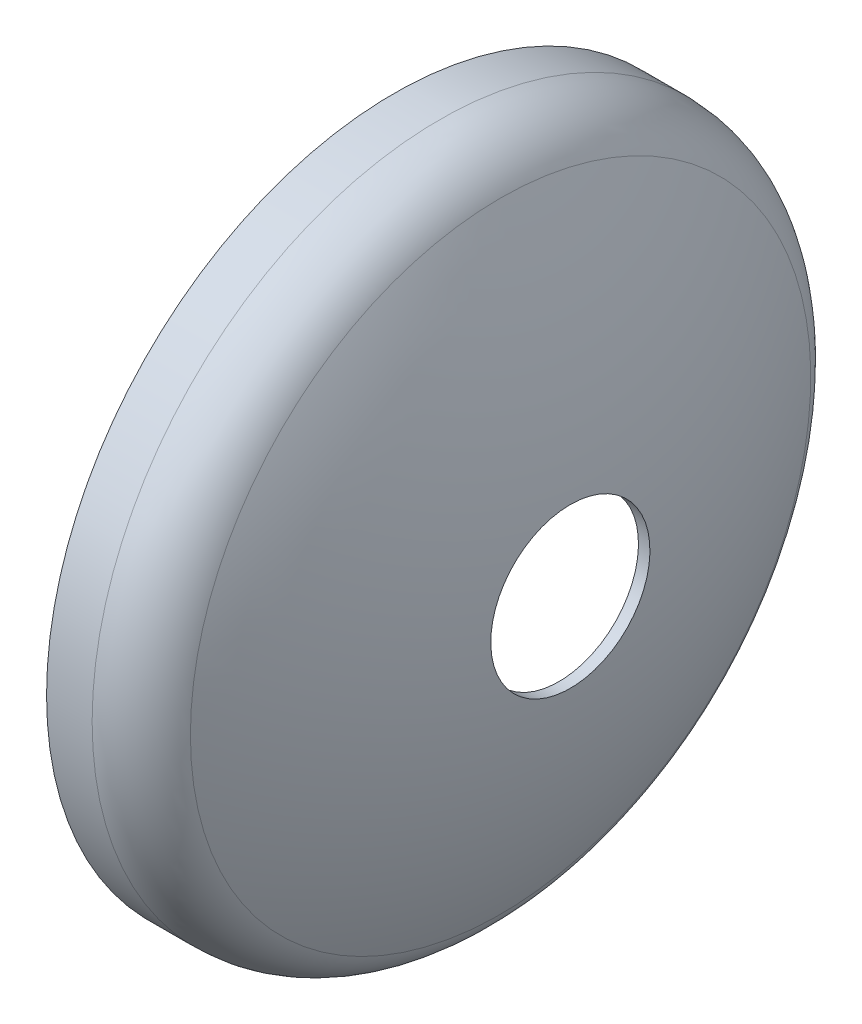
ISO-10303-21;
HEADER;
FILE_DESCRIPTION(('STEP AP214'),'2;1');
FILE_NAME('part.step','',(''),(''),'','','');
FILE_SCHEMA(('AUTOMOTIVE_DESIGN { 1 0 10303 214 1 1 1 1 }'));
ENDSEC;
DATA;
#1=APPLICATION_CONTEXT('core data for automotive mechanical design processes');
#2=APPLICATION_PROTOCOL_DEFINITION('international standard','automotive_design',2000,#1);
#3=PRODUCT_CONTEXT('',#1,'mechanical');
#4=PRODUCT('Part','Part','',(#3));
#5=PRODUCT_RELATED_PRODUCT_CATEGORY('part','',(#4));
#6=PRODUCT_DEFINITION_FORMATION('','',#4);
#7=PRODUCT_DEFINITION_CONTEXT('part definition',#1,'design');
#8=PRODUCT_DEFINITION('design','',#6,#7);
#9=PRODUCT_DEFINITION_SHAPE('','',#8);
#10=(LENGTH_UNIT() NAMED_UNIT(*) SI_UNIT(.MILLI.,.METRE.));
#11=(NAMED_UNIT(*) PLANE_ANGLE_UNIT() SI_UNIT($,.RADIAN.));
#12=(NAMED_UNIT(*) SI_UNIT($,.STERADIAN.) SOLID_ANGLE_UNIT());
#13=UNCERTAINTY_MEASURE_WITH_UNIT(LENGTH_MEASURE(1.E-05),#10,'distance_accuracy_value','');
#14=(GEOMETRIC_REPRESENTATION_CONTEXT(3) GLOBAL_UNCERTAINTY_ASSIGNED_CONTEXT((#13)) GLOBAL_UNIT_ASSIGNED_CONTEXT((#10,
#11,#12)) REPRESENTATION_CONTEXT('',''));
#15=CARTESIAN_POINT('',(0.,0.,0.));
#16=DIRECTION('',(0.,0.,1.));
#17=DIRECTION('',(1.,0.,0.));
#18=AXIS2_PLACEMENT_3D('',#15,#16,#17);
#19=CARTESIAN_POINT('',(108.777598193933,0.,0.));
#20=DIRECTION('',(-1.,0.,0.));
#21=DIRECTION('',(0.,1.,0.));
#22=AXIS2_PLACEMENT_3D('',#19,#20,#21);
#23=SPHERICAL_SURFACE('',#22,600.);
#24=CARTESIAN_POINT('',(643.46915575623,0.,0.));
#25=DIRECTION('',(-1.,0.,0.));
#26=DIRECTION('',(0.,0.,1.));
#27=AXIS2_PLACEMENT_3D('',#24,#25,#26);
#28=CIRCLE('',#27,272.222222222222);
#29=CARTESIAN_POINT('',(643.46915575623,272.222222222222,0.));
#30=VERTEX_POINT('',#29);
#31=EDGE_CURVE('E43',#30,#30,#28,.T.);
#32=CARTESIAN_POINT('',(704.697875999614,0.,0.));
#33=DIRECTION('',(-1.,0.,0.));
#34=DIRECTION('',(0.,0.,1.));
#35=AXIS2_PLACEMENT_3D('',#32,#33,#34);
#36=CIRCLE('',#35,69.85);
#37=CARTESIAN_POINT('',(704.697875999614,69.849999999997,0.));
#38=VERTEX_POINT('',#37);
#39=EDGE_CURVE('E57',#38,#38,#36,.F.);
#40=CARTESIAN_POINT('',(643.46915575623,272.222222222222,0.));
#41=CARTESIAN_POINT('',(644.473644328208,270.24923400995,0.));
#42=CARTESIAN_POINT('',(645.467211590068,268.270685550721,0.));
#43=CARTESIAN_POINT('',(647.43238386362,264.302711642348,0.));
#44=CARTESIAN_POINT('',(648.403988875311,262.313286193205,0.));
#45=CARTESIAN_POINT('',(650.325117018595,258.323801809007,0.));
#46=CARTESIAN_POINT('',(651.274640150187,256.323742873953,0.));
#47=CARTESIAN_POINT('',(653.151488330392,252.313236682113,0.));
#48=CARTESIAN_POINT('',(654.078813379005,250.302789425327,0.));
#49=CARTESIAN_POINT('',(655.911151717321,246.271752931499,0.));
#50=CARTESIAN_POINT('',(656.816165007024,244.251163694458,0.));
#51=CARTESIAN_POINT('',(658.603768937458,240.200090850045,0.));
#52=CARTESIAN_POINT('',(659.48635957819,238.169607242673,0.));
#53=CARTESIAN_POINT('',(661.229010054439,234.098994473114,0.));
#54=CARTESIAN_POINT('',(662.089069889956,232.058865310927,0.));
#55=CARTESIAN_POINT('',(663.786553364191,227.969211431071,0.));
#56=CARTESIAN_POINT('',(664.623977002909,225.919686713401,0.));
#57=CARTESIAN_POINT('',(666.27608546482,221.811492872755,0.));
#58=CARTESIAN_POINT('',(667.090770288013,219.752823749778,0.));
#59=CARTESIAN_POINT('',(668.697301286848,215.626593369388,0.));
#60=CARTESIAN_POINT('',(669.48914746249,213.559032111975,0.));
#61=CARTESIAN_POINT('',(671.049904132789,209.415270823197,0.));
#62=CARTESIAN_POINT('',(671.818814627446,207.339070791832,0.));
#63=CARTESIAN_POINT('',(673.333605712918,203.178286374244,0.));
#64=CARTESIAN_POINT('',(674.079486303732,201.093701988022,0.));
#65=CARTESIAN_POINT('',(675.548126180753,196.916404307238,0.));
#66=CARTESIAN_POINT('',(676.270885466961,194.823691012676,0.));
#67=CARTESIAN_POINT('',(677.693194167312,190.630391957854,0.));
#68=CARTESIAN_POINT('',(678.392743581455,188.529806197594,0.));
#69=CARTESIAN_POINT('',(679.768546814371,184.321019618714,0.));
#70=CARTESIAN_POINT('',(680.444800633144,182.212818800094,0.));
#71=CARTESIAN_POINT('',(681.773929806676,177.989060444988,0.));
#72=CARTESIAN_POINT('',(682.426805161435,175.873502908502,0.));
#73=CARTESIAN_POINT('',(683.709097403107,171.635290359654,0.));
#74=CARTESIAN_POINT('',(684.338514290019,169.512635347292,0.));
#75=CARTESIAN_POINT('',(685.573812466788,165.260487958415,0.));
#76=CARTESIAN_POINT('',(686.179693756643,163.130995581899,0.));
#77=CARTESIAN_POINT('',(687.367846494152,158.865434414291,0.));
#78=CARTESIAN_POINT('',(687.950117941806,156.729365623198,0.));
#79=CARTESIAN_POINT('',(689.090979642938,152.45091338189,0.));
#80=CARTESIAN_POINT('',(689.649569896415,150.308529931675,0.));
#81=CARTESIAN_POINT('',(690.743000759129,146.017710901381,0.));
#82=CARTESIAN_POINT('',(691.277841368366,143.869275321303,0.));
#83=CARTESIAN_POINT('',(692.323707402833,139.566615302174,0.));
#84=CARTESIAN_POINT('',(692.834732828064,137.412390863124,0.));
#85=CARTESIAN_POINT('',(693.832905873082,133.098417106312,0.));
#86=CARTESIAN_POINT('',(694.320053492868,130.93866778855,0.));
#87=CARTESIAN_POINT('',(695.270411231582,126.613908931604,0.));
#88=CARTESIAN_POINT('',(695.733621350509,124.448899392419,0.));
#89=CARTESIAN_POINT('',(696.63604732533,120.113885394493,0.));
#90=CARTESIAN_POINT('',(697.075263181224,117.943880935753,0.));
#91=CARTESIAN_POINT('',(697.929646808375,113.599143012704,0.));
#92=CARTESIAN_POINT('',(698.344814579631,111.424409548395,0.));
#93=CARTESIAN_POINT('',(699.151051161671,107.070480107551,0.));
#94=CARTESIAN_POINT('',(699.542119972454,104.891284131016,0.));
#95=CARTESIAN_POINT('',(700.300110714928,100.528696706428,0.));
#96=CARTESIAN_POINT('',(700.667032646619,98.3453052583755,0.));
#97=CARTESIAN_POINT('',(701.376684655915,93.9745944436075,0.));
#98=CARTESIAN_POINT('',(701.719414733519,91.7872750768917,0.));
#99=CARTESIAN_POINT('',(702.380641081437,87.4089764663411,0.));
#100=CARTESIAN_POINT('',(702.699137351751,85.2179972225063,0.));
#101=CARTESIAN_POINT('',(703.311856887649,80.8326473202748,0.));
#102=CARTESIAN_POINT('',(703.606080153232,78.6382766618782,0.));
#103=CARTESIAN_POINT('',(704.17021825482,74.246412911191,0.));
#104=CARTESIAN_POINT('',(704.440133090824,72.0489198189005,0.));
#105=CARTESIAN_POINT('',(704.697875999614,69.849999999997,0.));
#106=B_SPLINE_CURVE_WITH_KNOTS('',3,(#40,#41,#42,#43,#44,#45,#46,#47,#48,#49,#50,#51,#52,#53,
#54,#55,#56,#57,#58,#59,#60,#61,#62,#63,#64,#65,#66,#67,#68,#69,#70,#71,#72,#73,#74,#75,#76,#77,
#78,#79,#80,#81,#82,#83,#84,#85,#86,#87,#88,#89,#90,#91,#92,#93,#94,#95,#96,#97,#98,#99,#100,
#101,#102,#103,#104,#105),.UNSPECIFIED.,.F.,.F.,(4,2,2,2,2,2,2,2,2,2,2,2,2,2,2,2,2,2,2,2,2,2,2,
2,2,2,2,2,2,2,2,2,4),(0.,6.6418873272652,13.2837746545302,19.9256619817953,26.5675493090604,
33.2094366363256,39.8513239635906,46.4932112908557,53.1350986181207,59.7769859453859,
66.4188732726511,73.0607605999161,79.7026479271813,86.3445352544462,92.9864225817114,
99.6283099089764,106.270197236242,112.912084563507,119.553971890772,126.195859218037,
132.837746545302,139.479633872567,146.121521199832,152.763408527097,159.405295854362,
166.047183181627,172.689070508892,179.330957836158,185.972845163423,192.614732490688,
199.256619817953,205.898507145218,212.540394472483),.UNSPECIFIED.);
#107=EDGE_CURVE('BSEAM31',#30,#38,#106,.T.);
#108=ORIENTED_EDGE('',*,*,#31,.F.);
#109=ORIENTED_EDGE('',*,*,#39,.F.);
#110=ORIENTED_EDGE('',*,*,#107,.T.);
#111=ORIENTED_EDGE('',*,*,#107,.F.);
#112=EDGE_LOOP('',(#108,#110,#109,#111));
#113=FACE_BOUND('',#112,.T.);
#114=ADVANCED_FACE('F31',(#113),#23,.T.);
#115=CARTESIAN_POINT('',(108.777598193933,0.,0.));
#116=DIRECTION('',(-1.,0.,0.));
#117=DIRECTION('',(0.,1.,0.));
#118=AXIS2_PLACEMENT_3D('',#115,#116,#117);
#119=SPHERICAL_SURFACE('',#118,590.);
#120=CARTESIAN_POINT('',(634.557629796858,0.,0.));
#121=DIRECTION('',(-1.,0.,0.));
#122=DIRECTION('',(0.,0.,1.));
#123=AXIS2_PLACEMENT_3D('',#120,#121,#122);
#124=CIRCLE('',#123,267.685185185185);
#125=CARTESIAN_POINT('',(634.557629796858,267.685185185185,0.));
#126=VERTEX_POINT('',#125);
#127=EDGE_CURVE('E48',#126,#126,#124,.T.);
#128=CARTESIAN_POINT('',(694.62824255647,0.,0.));
#129=DIRECTION('',(-1.,0.,0.));
#130=DIRECTION('',(0.,0.,1.));
#131=AXIS2_PLACEMENT_3D('',#128,#129,#130);
#132=CIRCLE('',#131,69.85);
#133=CARTESIAN_POINT('',(694.62824255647,69.8499999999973,0.));
#134=VERTEX_POINT('',#133);
#135=EDGE_CURVE('E35',#134,#134,#132,.T.);
#136=CARTESIAN_POINT('',(634.557629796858,267.685185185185,0.));
#137=CARTESIAN_POINT('',(635.539836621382,265.755962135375,0.));
#138=CARTESIAN_POINT('',(636.511424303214,263.82133267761,0.));
#139=CARTESIAN_POINT('',(638.433245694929,259.941496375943,0.));
#140=CARTESIAN_POINT('',(639.383479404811,257.99628953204,0.));
#141=CARTESIAN_POINT('',(641.262477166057,254.09553388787,0.));
#142=CARTESIAN_POINT('',(642.19124121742,252.139985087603,0.));
#143=CARTESIAN_POINT('',(644.027187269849,248.218782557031,0.));
#144=CARTESIAN_POINT('',(644.934369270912,246.253128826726,0.));
#145=CARTESIAN_POINT('',(646.727041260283,242.311954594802,0.));
#146=CARTESIAN_POINT('',(647.612531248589,240.336434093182,0.));
#147=CARTESIAN_POINT('',(649.361711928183,236.375765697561,0.));
#148=CARTESIAN_POINT('',(650.225402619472,234.390617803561,0.));
#149=CARTESIAN_POINT('',(651.930880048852,230.410935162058,0.));
#150=CARTESIAN_POINT('',(652.772666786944,228.416400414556,0.));
#151=CARTESIAN_POINT('',(654.434234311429,224.418185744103,0.));
#152=CARTESIAN_POINT('',(655.254015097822,222.414505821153,0.));
#153=CARTESIAN_POINT('',(656.871471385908,218.398243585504,0.));
#154=CARTESIAN_POINT('',(657.6691468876,216.385661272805,0.));
#155=CARTESIAN_POINT('',(659.242295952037,212.351838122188,0.));
#156=CARTESIAN_POINT('',(660.017769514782,210.330597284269,0.));
#157=CARTESIAN_POINT('',(661.546420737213,206.279701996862,0.));
#158=CARTESIAN_POINT('',(662.299598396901,204.250047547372,0.));
#159=CARTESIAN_POINT('',(663.783566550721,200.182570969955,0.));
#160=CARTESIAN_POINT('',(664.514357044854,198.144748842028,0.));
#161=CARTESIAN_POINT('',(665.953462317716,194.061183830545,0.));
#162=CARTESIAN_POINT('',(666.661777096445,192.015440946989,0.));
#163=CARTESIAN_POINT('',(668.055845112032,187.916282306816,0.));
#164=CARTESIAN_POINT('',(668.74159834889,185.862866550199,0.));
#165=CARTESIAN_POINT('',(670.090460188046,181.748610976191,0.));
#166=CARTESIAN_POINT('',(670.753568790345,179.687771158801,0.));
#167=CARTESIAN_POINT('',(672.057061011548,175.558917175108,0.));
#168=CARTESIAN_POINT('',(672.697444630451,173.490903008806,0.));
#169=CARTESIAN_POINT('',(673.95540928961,169.347950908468,0.));
#170=CARTESIAN_POINT('',(674.572990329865,167.273012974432,0.));
#171=CARTESIAN_POINT('',(675.785274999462,163.116464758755,0.));
#172=CARTESIAN_POINT('',(676.379978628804,161.034854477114,0.));
#173=CARTESIAN_POINT('',(677.546436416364,156.865213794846,0.));
#174=CARTESIAN_POINT('',(678.118190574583,154.777183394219,0.));
#175=CARTESIAN_POINT('',(679.238680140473,150.59495548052,0.));
#176=CARTESIAN_POINT('',(679.787415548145,148.500757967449,0.));
#177=CARTESIAN_POINT('',(680.861801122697,144.306449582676,0.));
#178=CARTESIAN_POINT('',(681.387451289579,142.206338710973,0.));
#179=CARTESIAN_POINT('',(682.415602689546,138.000458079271,0.));
#180=CARTESIAN_POINT('',(682.918103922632,135.89468831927,0.));
#181=CARTESIAN_POINT('',(683.899896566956,131.677745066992,0.));
#182=CARTESIAN_POINT('',(684.379187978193,129.566571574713,0.));
#183=CARTESIAN_POINT('',(685.314502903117,125.339076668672,0.));
#184=CARTESIAN_POINT('',(685.770526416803,123.222755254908,0.));
#185=CARTESIAN_POINT('',(686.659250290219,118.985220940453,0.));
#186=CARTESIAN_POINT('',(687.091950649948,116.86400803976,0.));
#187=CARTESIAN_POINT('',(687.93397578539,112.616947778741,0.));
#188=CARTESIAN_POINT('',(688.343300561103,110.491100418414,0.));
#189=CARTESIAN_POINT('',(689.138524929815,106.235028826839,0.));
#190=CARTESIAN_POINT('',(689.524424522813,104.104804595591,0.));
#191=CARTESIAN_POINT('',(690.27275176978,99.8402373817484,0.));
#192=CARTESIAN_POINT('',(690.635179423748,97.7058943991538,0.));
#193=CARTESIAN_POINT('',(691.33651886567,93.4333482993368,0.));
#194=CARTESIAN_POINT('',(691.675430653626,91.2951451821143,0.));
#195=CARTESIAN_POINT('',(692.329697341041,87.0151379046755,0.));
#196=CARTESIAN_POINT('',(692.6450522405,84.8733337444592,0.));
#197=CARTESIAN_POINT('',(693.252166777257,80.5863838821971,0.));
#198=CARTESIAN_POINT('',(693.543926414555,78.4412381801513,0.));
#199=CARTESIAN_POINT('',(694.10381567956,74.1478652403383,0.));
#200=CARTESIAN_POINT('',(694.371945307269,71.9996380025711,0.));
#201=CARTESIAN_POINT('',(694.62824255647,69.8499999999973,0.));
#202=B_SPLINE_CURVE_WITH_KNOTS('',3,(#136,#137,#138,#139,#140,#141,#142,#143,#144,#145,#146,
#147,#148,#149,#150,#151,#152,#153,#154,#155,#156,#157,#158,#159,#160,#161,#162,#163,#164,#165,
#166,#167,#168,#169,#170,#171,#172,#173,#174,#175,#176,#177,#178,#179,#180,#181,#182,#183,#184,
#185,#186,#187,#188,#189,#190,#191,#192,#193,#194,#195,#196,#197,#198,#199,#200,#201),
.UNSPECIFIED.,.F.,.F.,(4,2,2,2,2,2,2,2,2,2,2,2,2,2,2,2,2,2,2,2,2,2,2,2,2,2,2,2,2,2,2,2,4),(0.,
6.4945562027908,12.9891124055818,19.4836686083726,25.9782248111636,32.4727810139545,
38.9673372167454,45.4618934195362,51.9564496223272,58.4510058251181,64.945562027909,
71.4401182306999,77.9346744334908,84.4292306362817,90.9237868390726,97.4183430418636,
103.912899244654,110.407455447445,116.902011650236,123.396567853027,129.891124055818,
136.385680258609,142.8802364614,149.374792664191,155.869348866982,162.363905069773,
168.858461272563,175.353017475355,181.847573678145,188.342129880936,194.836686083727,
201.331242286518,207.825798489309),.UNSPECIFIED.);
#203=EDGE_CURVE('BSEAM66',#126,#134,#202,.T.);
#204=ORIENTED_EDGE('',*,*,#127,.T.);
#205=ORIENTED_EDGE('',*,*,#135,.F.);
#206=ORIENTED_EDGE('',*,*,#203,.T.);
#207=ORIENTED_EDGE('',*,*,#203,.F.);
#208=EDGE_LOOP('',(#204,#206,#205,#207));
#209=FACE_BOUND('',#208,.T.);
#210=ADVANCED_FACE('F66',(#209),#119,.F.);
#211=CARTESIAN_POINT('',(550.,305.,0.));
#212=DIRECTION('',(1.,0.,0.));
#213=DIRECTION('',(0.,0.,-1.));
#214=AXIS2_PLACEMENT_3D('',#211,#212,#213);
#215=PLANE('',#214);
#216=CARTESIAN_POINT('',(550.,0.,0.));
#217=DIRECTION('',(-1.,0.,0.));
#218=DIRECTION('',(0.,0.,1.));
#219=AXIS2_PLACEMENT_3D('',#216,#217,#218);
#220=CIRCLE('',#219,295.);
#221=CARTESIAN_POINT('',(550.,0.,295.));
#222=VERTEX_POINT('',#221);
#223=EDGE_CURVE('E54',#222,#222,#220,.T.);
#224=ORIENTED_EDGE('',*,*,#223,.F.);
#225=EDGE_LOOP('',(#224));
#226=FACE_BOUND('',#225,.T.);
#227=CARTESIAN_POINT('',(550.,0.,0.));
#228=DIRECTION('',(-1.,0.,0.));
#229=DIRECTION('',(0.,0.,1.));
#230=AXIS2_PLACEMENT_3D('',#227,#228,#229);
#231=CIRCLE('',#230,305.);
#232=CARTESIAN_POINT('',(550.,0.,305.));
#233=VERTEX_POINT('',#232);
#234=EDGE_CURVE('E10',#233,#233,#231,.T.);
#235=ORIENTED_EDGE('',*,*,#234,.T.);
#236=EDGE_LOOP('',(#235));
#237=FACE_BOUND('',#236,.T.);
#238=ADVANCED_FACE('F33',(#226,#237),#215,.F.);
#239=CARTESIAN_POINT('',(57.190131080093,0.,0.));
#240=DIRECTION('',(-1.,0.,0.));
#241=DIRECTION('',(0.,0.,1.));
#242=AXIS2_PLACEMENT_3D('',#239,#240,#241);
#243=CYLINDRICAL_SURFACE('',#242,305.);
#244=ORIENTED_EDGE('',*,*,#234,.F.);
#245=EDGE_LOOP('',(#244));
#246=FACE_BOUND('',#245,.T.);
#247=CARTESIAN_POINT('',(590.,0.,0.));
#248=DIRECTION('',(-1.,0.,0.));
#249=DIRECTION('',(0.,0.,1.));
#250=AXIS2_PLACEMENT_3D('',#247,#248,#249);
#251=CIRCLE('',#250,305.);
#252=CARTESIAN_POINT('',(590.,0.,305.));
#253=VERTEX_POINT('',#252);
#254=EDGE_CURVE('E39',#253,#253,#251,.T.);
#255=ORIENTED_EDGE('',*,*,#254,.T.);
#256=EDGE_LOOP('',(#255));
#257=FACE_BOUND('',#256,.T.);
#258=ADVANCED_FACE('F74',(#246,#257),#243,.T.);
#259=CARTESIAN_POINT('',(590.,0.,0.));
#260=DIRECTION('',(-1.,0.,0.));
#261=DIRECTION('',(0.,0.,1.));
#262=AXIS2_PLACEMENT_3D('',#259,#260,#261);
#263=TOROIDAL_SURFACE('',#262,245.,60.);
#264=ORIENTED_EDGE('',*,*,#254,.F.);
#265=EDGE_LOOP('',(#264));
#266=FACE_BOUND('',#265,.T.);
#267=ORIENTED_EDGE('',*,*,#31,.T.);
#268=EDGE_LOOP('',(#267));
#269=FACE_BOUND('',#268,.T.);
#270=ADVANCED_FACE('F82',(#266,#269),#263,.T.);
#271=CARTESIAN_POINT('',(590.,0.,0.));
#272=DIRECTION('',(-1.,0.,0.));
#273=DIRECTION('',(0.,0.,1.));
#274=AXIS2_PLACEMENT_3D('',#271,#272,#273);
#275=TOROIDAL_SURFACE('',#274,245.,49.9999999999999);
#276=ORIENTED_EDGE('',*,*,#127,.F.);
#277=EDGE_LOOP('',(#276));
#278=FACE_BOUND('',#277,.T.);
#279=CARTESIAN_POINT('',(590.,0.,0.));
#280=DIRECTION('',(-1.,0.,0.));
#281=DIRECTION('',(0.,0.,1.));
#282=AXIS2_PLACEMENT_3D('',#279,#280,#281);
#283=CIRCLE('',#282,295.);
#284=CARTESIAN_POINT('',(590.,0.,295.));
#285=VERTEX_POINT('',#284);
#286=EDGE_CURVE('E51',#285,#285,#283,.T.);
#287=ORIENTED_EDGE('',*,*,#286,.T.);
#288=EDGE_LOOP('',(#287));
#289=FACE_BOUND('',#288,.T.);
#290=ADVANCED_FACE('F79',(#278,#289),#275,.F.);
#291=CARTESIAN_POINT('',(57.190131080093,0.,0.));
#292=DIRECTION('',(-1.,0.,0.));
#293=DIRECTION('',(0.,0.,1.));
#294=AXIS2_PLACEMENT_3D('',#291,#292,#293);
#295=CYLINDRICAL_SURFACE('',#294,295.);
#296=ORIENTED_EDGE('',*,*,#286,.F.);
#297=EDGE_LOOP('',(#296));
#298=FACE_BOUND('',#297,.T.);
#299=ORIENTED_EDGE('',*,*,#223,.T.);
#300=EDGE_LOOP('',(#299));
#301=FACE_BOUND('',#300,.T.);
#302=ADVANCED_FACE('F106',(#298,#301),#295,.F.);
#303=CARTESIAN_POINT('',(1995.43745629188,0.,0.));
#304=DIRECTION('',(-1.,0.,0.));
#305=DIRECTION('',(0.,0.,1.));
#306=AXIS2_PLACEMENT_3D('',#303,#304,#305);
#307=CYLINDRICAL_SURFACE('',#306,69.85);
#308=ORIENTED_EDGE('',*,*,#135,.T.);
#309=EDGE_LOOP('',(#308));
#310=FACE_BOUND('',#309,.T.);
#311=ORIENTED_EDGE('',*,*,#39,.T.);
#312=EDGE_LOOP('',(#311));
#313=FACE_BOUND('',#312,.T.);
#314=ADVANCED_FACE('F64',(#310,#313),#307,.F.);
#315=CLOSED_SHELL('',(#114,#210,#238,#258,#270,#290,#302,#314));
#316=MANIFOLD_SOLID_BREP('B2',#315);
#317=ADVANCED_BREP_SHAPE_REPRESENTATION('',(#18,#316),#14);
#318=SHAPE_DEFINITION_REPRESENTATION(#9,#317);
ENDSEC;
END-ISO-10303-21;
